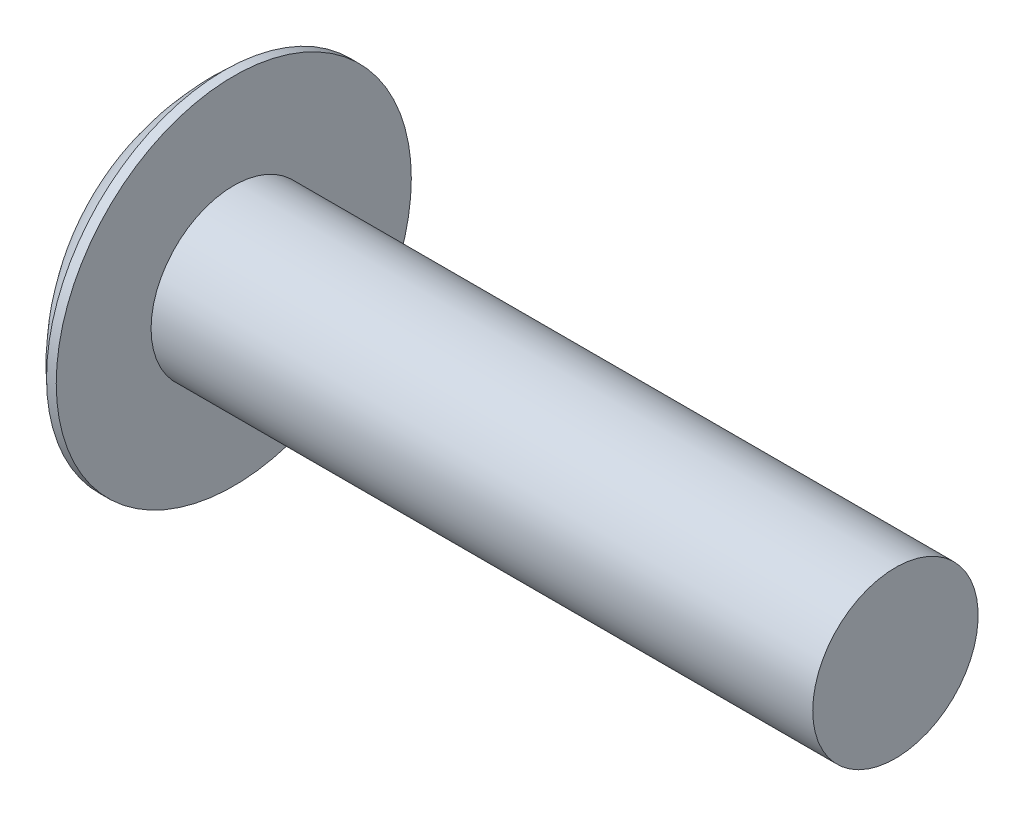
from build123d import *

# Parameters (mm, degrees)
SKETCH2_W         = 20.447
SKETCH2_H         = 2.2098
SLOT_DEPTH        = 2.8448
CIRPATTERN1_COUNT = 2
CIRPATTERN1_ANGLE = 90


with BuildPart() as part:
    # BodySke → Base-Revolve (revolve)
    with BuildSketch(Plane.XY, mode=Mode.PRIVATE) as base_revolve_sk:
        with BuildLine():
            Line((5.1562, 4.7625), (5.1562, 10.2235))
            Line((5.1562, 10.2235), (4.597800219, 10.2235))
            ThreePointArc((4.597800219, 10.2235), (1.202344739, 5.604902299), (0, 0))
            Line((0, 0), (43.2562, 0))
            Line((43.2562, 0), (43.2562, 4.7625))
            Line((43.2562, 4.7625), (5.1562, 4.7625))
        make_face()
    revolve(base_revolve_sk.sketch.rotate(Axis((-25.4, 0, 0), (1, 0, 0)), 90), axis=Axis((-25.4, 0, 0), (1, 0, 0)))

    # Sketch2 → Slot (cut)
    with BuildSketch(Plane(origin=(0, 0, 0), x_dir=(0, 0, -1), z_dir=(1, 0, 0))):
        Rectangle(SKETCH2_W, SKETCH2_H)
    extrude(amount=SLOT_DEPTH, mode=Mode.SUBTRACT)

    # Sketch3 → Cross section 0
    with BuildSketch(Plane(origin=(0, 0, 0), x_dir=(0, 0, -1), z_dir=(1, 0, 0))):
        with BuildLine():
            Line((1.2319, -7.4676), (-1.2319, -7.4676))
            Line((-1.2319, -7.4676), (-1.2319, 7.4676))
            Line((-1.2319, 7.4676), (1.2319, 7.4676))
            Line((1.2319, 7.4676), (1.2319, -7.4676))
        make_face()
    # Sketch4 → Cross section 1
    with BuildSketch(Plane(origin=(8.9916, 0, 0), x_dir=(0, 0, -1), z_dir=(1, 0, 0))):
        with BuildLine():
            Line((0.61595, -0.61595), (-0.61595, -0.61595))
            Line((-0.61595, -0.61595), (-0.61595, 0.61595))
            Line((-0.61595, 0.61595), (0.61595, 0.61595))
            Line((0.61595, 0.61595), (0.61595, -0.61595))
        make_face()
    cross = loft(mode=Mode.SUBTRACT)

    # CirPattern1: Cross ×2 about axis
    cirpattern1_axis = Axis((0, 0, 0), (1, 0, 0))
    for i in range(1, CIRPATTERN1_COUNT):
        add(cross.rotate(cirpattern1_axis, i * CIRPATTERN1_ANGLE / (CIRPATTERN1_COUNT - 1)), mode=Mode.SUBTRACT)


solid = part.part
